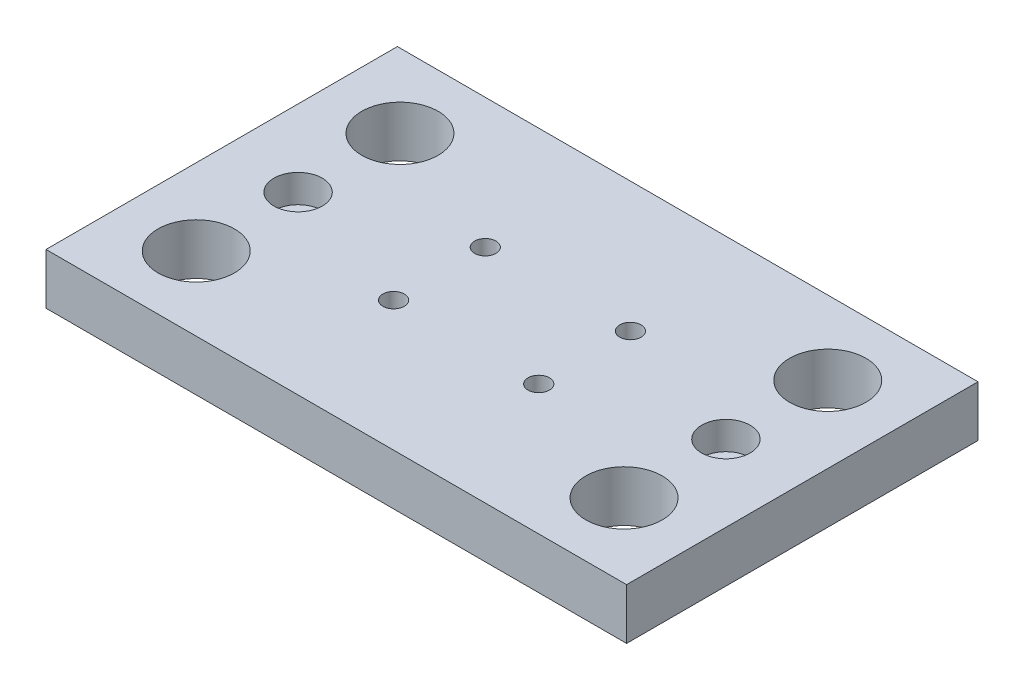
from build123d import *

# Parameters (mm, degrees)
SKETCH_1_W          = 114
SKETCH_1_H          = 10
EXTRUDE_1_DEPTH     = 69
SKETCH_2_R          = 7.5
SKETCH_2_R_2        = 2.75
SKETCH_2_R_3        = 2.1
CUT_EXTRUDE_1_DEPTH = 69
SKETCH_3_R          = 4.75
CUT_EXTRUDE_2_DEPTH = 5.5


with BuildPart() as part:
    # Sketch 1 → Extrude 1 (new body)
    with BuildSketch(Plane.XY):
        with Locations((57, 5)):
            Rectangle(SKETCH_1_W, SKETCH_1_H)
    extrude(amount=EXTRUDE_1_DEPTH)

    # Sketch 2 → Cut-Extrude 1 (cut)
    with BuildSketch(Plane(origin=(0, 10, 0), x_dir=(1, 0, 0), z_dir=(0, 1, 0))):
        with Locations(Location((15, -14.5, 0), (0, 0, 270))):
            Circle(SKETCH_2_R)
        with Locations(Location((99, -14.5, 0), (0, 0, 270))):
            Circle(SKETCH_2_R)
        with Locations(Location((99, -54.5, 0), (0, 0, 270))):
            Circle(SKETCH_2_R)
        with Locations(Location((15, -54.5, 0), (0, 0, 270))):
            Circle(SKETCH_2_R)
        with Locations(Location((15, -34.5, 0), (0, 0, 270))):
            Circle(SKETCH_2_R_2)
        with Locations(Location((99, -34.5, 0), (0, 0, 270))):
            Circle(SKETCH_2_R_2)
        with Locations(Location((42.75, -43.5, 0), (0, 0, 270))):
            Circle(SKETCH_2_R_3)
        with Locations(Location((42.75, -25.5, 0), (0, 0, 270))):
            Circle(SKETCH_2_R_3)
        with Locations(Location((71.25, -25.5, 0), (0, 0, 270))):
            Circle(SKETCH_2_R_3)
        with Locations(Location((71.25, -43.5, 0), (0, 0, 270))):
            Circle(SKETCH_2_R_3)
    extrude(amount=-CUT_EXTRUDE_1_DEPTH, mode=Mode.SUBTRACT)

    # Sketch 3 → Cut-Extrude 2 (cut)
    with BuildSketch(Plane(origin=(0, 10, 0), x_dir=(1, 0, 0), z_dir=(0, 1, 0))):
        with Locations(Location((15, -34.5, 0), (0, 0, 270))):
            Circle(SKETCH_3_R)
        with Locations(Location((99, -34.5, 0), (0, 0, 270))):
            Circle(SKETCH_3_R)
    extrude(amount=-CUT_EXTRUDE_2_DEPTH, mode=Mode.SUBTRACT)


solid = part.part
